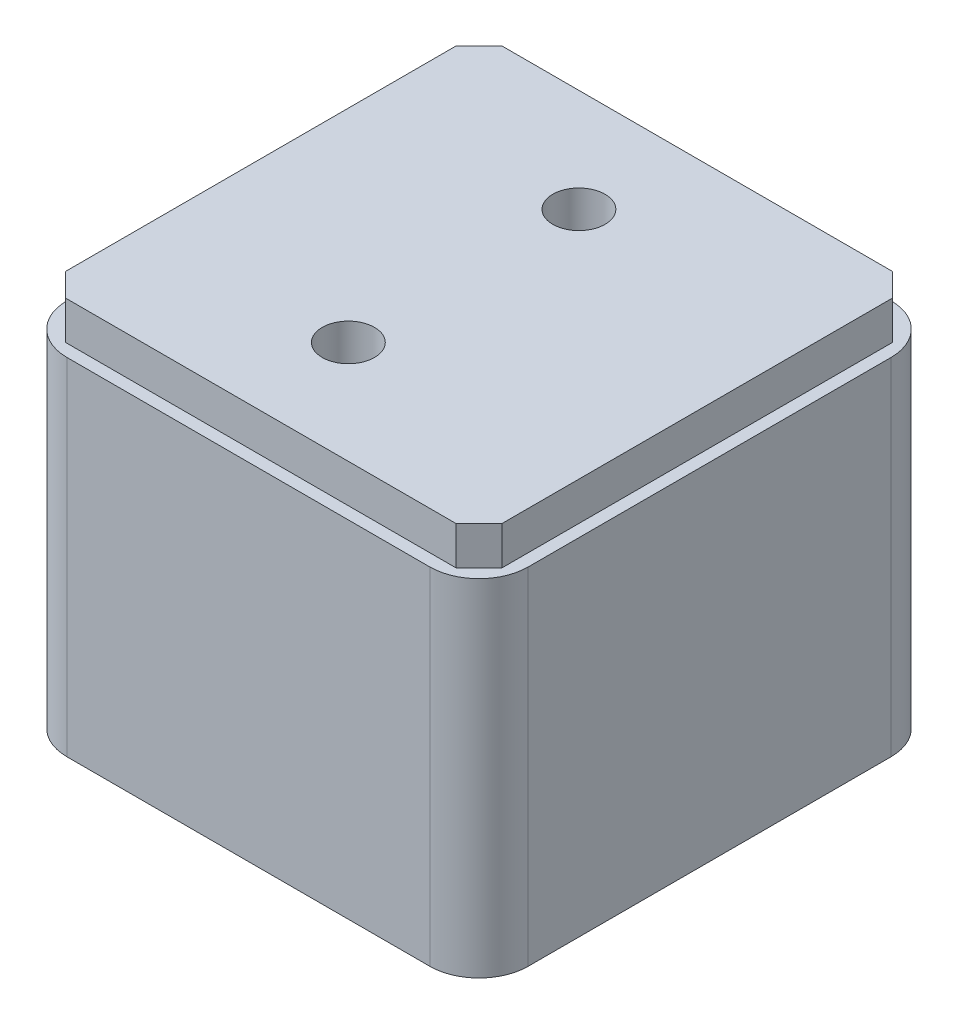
ISO-10303-21;
HEADER;
FILE_DESCRIPTION(('STEP AP214'),'2;1');
FILE_NAME('part.step','',(''),(''),'','','');
FILE_SCHEMA(('AUTOMOTIVE_DESIGN { 1 0 10303 214 1 1 1 1 }'));
ENDSEC;
DATA;
#1=APPLICATION_CONTEXT('core data for automotive mechanical design processes');
#2=APPLICATION_PROTOCOL_DEFINITION('international standard','automotive_design',2000,#1);
#3=PRODUCT_CONTEXT('',#1,'mechanical');
#4=PRODUCT('Part','Part','',(#3));
#5=PRODUCT_RELATED_PRODUCT_CATEGORY('part','',(#4));
#6=PRODUCT_DEFINITION_FORMATION('','',#4);
#7=PRODUCT_DEFINITION_CONTEXT('part definition',#1,'design');
#8=PRODUCT_DEFINITION('design','',#6,#7);
#9=PRODUCT_DEFINITION_SHAPE('','',#8);
#10=(LENGTH_UNIT() NAMED_UNIT(*) SI_UNIT(.MILLI.,.METRE.));
#11=(NAMED_UNIT(*) PLANE_ANGLE_UNIT() SI_UNIT($,.RADIAN.));
#12=(NAMED_UNIT(*) SI_UNIT($,.STERADIAN.) SOLID_ANGLE_UNIT());
#13=UNCERTAINTY_MEASURE_WITH_UNIT(LENGTH_MEASURE(1.E-05),#10,'distance_accuracy_value','');
#14=(GEOMETRIC_REPRESENTATION_CONTEXT(3) GLOBAL_UNCERTAINTY_ASSIGNED_CONTEXT((#13)) GLOBAL_UNIT_ASSIGNED_CONTEXT((#10,
#11,#12)) REPRESENTATION_CONTEXT('',''));
#15=CARTESIAN_POINT('',(0.,0.,0.));
#16=DIRECTION('',(0.,0.,1.));
#17=DIRECTION('',(1.,0.,0.));
#18=AXIS2_PLACEMENT_3D('',#15,#16,#17);
#19=CARTESIAN_POINT('',(-28.4,45.,25.4));
#20=DIRECTION('',(-0.707106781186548,0.,0.707106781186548));
#21=DIRECTION('',(0.707106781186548,0.,0.707106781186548));
#22=AXIS2_PLACEMENT_3D('',#19,#20,#21);
#23=PLANE('',#22);
#24=DIRECTION('',(0.707106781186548,0.,0.707106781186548));
#25=VECTOR('',#24,1.);
#26=CARTESIAN_POINT('',(-28.4,50.,25.4));
#27=LINE('',#26,#25);
#28=CARTESIAN_POINT('',(-28.4,50.,25.4));
#29=VERTEX_POINT('',#28);
#30=CARTESIAN_POINT('',(-25.4,50.,28.4));
#31=VERTEX_POINT('',#30);
#32=EDGE_CURVE('E181',#29,#31,#27,.T.);
#33=ORIENTED_EDGE('',*,*,#32,.F.);
#34=DIRECTION('',(0.,1.,0.));
#35=VECTOR('',#34,1.);
#36=CARTESIAN_POINT('',(-28.4,45.,25.4));
#37=LINE('',#36,#35);
#38=CARTESIAN_POINT('',(-28.4,45.,25.4));
#39=VERTEX_POINT('',#38);
#40=EDGE_CURVE('E13',#39,#29,#37,.T.);
#41=ORIENTED_EDGE('',*,*,#40,.F.);
#42=DIRECTION('',(0.707106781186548,0.,0.707106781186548));
#43=VECTOR('',#42,1.);
#44=CARTESIAN_POINT('',(-28.4,45.,25.4));
#45=LINE('',#44,#43);
#46=CARTESIAN_POINT('',(-25.4,45.,28.4));
#47=VERTEX_POINT('',#46);
#48=EDGE_CURVE('E202',#39,#47,#45,.T.);
#49=ORIENTED_EDGE('',*,*,#48,.T.);
#50=DIRECTION('',(0.,1.,0.));
#51=VECTOR('',#50,1.);
#52=CARTESIAN_POINT('',(-25.4,45.,28.4));
#53=LINE('',#52,#51);
#54=EDGE_CURVE('E87',#47,#31,#53,.T.);
#55=ORIENTED_EDGE('',*,*,#54,.T.);
#56=EDGE_LOOP('',(#33,#41,#49,#55));
#57=FACE_BOUND('',#56,.T.);
#58=ADVANCED_FACE('F84',(#57),#23,.T.);
#59=CARTESIAN_POINT('',(-28.4,45.,-25.4));
#60=DIRECTION('',(-1.,0.,0.));
#61=DIRECTION('',(0.,0.,1.));
#62=AXIS2_PLACEMENT_3D('',#59,#60,#61);
#63=PLANE('',#62);
#64=DIRECTION('',(0.,0.,1.));
#65=VECTOR('',#64,1.);
#66=CARTESIAN_POINT('',(-28.4,50.,-25.4));
#67=LINE('',#66,#65);
#68=CARTESIAN_POINT('',(-28.4,50.,-25.4));
#69=VERTEX_POINT('',#68);
#70=EDGE_CURVE('E200',#69,#29,#67,.T.);
#71=ORIENTED_EDGE('',*,*,#70,.F.);
#72=DIRECTION('',(0.,1.,0.));
#73=VECTOR('',#72,1.);
#74=CARTESIAN_POINT('',(-28.4,45.,-25.4));
#75=LINE('',#74,#73);
#76=CARTESIAN_POINT('',(-28.4,45.,-25.4));
#77=VERTEX_POINT('',#76);
#78=EDGE_CURVE('E93',#77,#69,#75,.T.);
#79=ORIENTED_EDGE('',*,*,#78,.F.);
#80=DIRECTION('',(0.,0.,1.));
#81=VECTOR('',#80,1.);
#82=CARTESIAN_POINT('',(-28.4,45.,-25.4));
#83=LINE('',#82,#81);
#84=EDGE_CURVE('E171',#77,#39,#83,.T.);
#85=ORIENTED_EDGE('',*,*,#84,.T.);
#86=ORIENTED_EDGE('',*,*,#40,.T.);
#87=EDGE_LOOP('',(#71,#79,#85,#86));
#88=FACE_BOUND('',#87,.T.);
#89=ADVANCED_FACE('F214',(#88),#63,.T.);
#90=CARTESIAN_POINT('',(-25.4,45.,-28.4));
#91=DIRECTION('',(-0.707106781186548,0.,-0.707106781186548));
#92=DIRECTION('',(-0.707106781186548,0.,0.707106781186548));
#93=AXIS2_PLACEMENT_3D('',#90,#91,#92);
#94=PLANE('',#93);
#95=DIRECTION('',(-0.707106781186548,0.,0.707106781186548));
#96=VECTOR('',#95,1.);
#97=CARTESIAN_POINT('',(-25.4,50.,-28.4));
#98=LINE('',#97,#96);
#99=CARTESIAN_POINT('',(-25.4,50.,-28.4));
#100=VERTEX_POINT('',#99);
#101=EDGE_CURVE('E158',#100,#69,#98,.T.);
#102=ORIENTED_EDGE('',*,*,#101,.F.);
#103=DIRECTION('',(0.,1.,0.));
#104=VECTOR('',#103,1.);
#105=CARTESIAN_POINT('',(-25.4,45.,-28.4));
#106=LINE('',#105,#104);
#107=CARTESIAN_POINT('',(-25.4,45.,-28.4));
#108=VERTEX_POINT('',#107);
#109=EDGE_CURVE('E153',#108,#100,#106,.T.);
#110=ORIENTED_EDGE('',*,*,#109,.F.);
#111=DIRECTION('',(-0.707106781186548,0.,0.707106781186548));
#112=VECTOR('',#111,1.);
#113=CARTESIAN_POINT('',(-25.4,45.,-28.4));
#114=LINE('',#113,#112);
#115=EDGE_CURVE('E156',#108,#77,#114,.T.);
#116=ORIENTED_EDGE('',*,*,#115,.T.);
#117=ORIENTED_EDGE('',*,*,#78,.T.);
#118=EDGE_LOOP('',(#102,#110,#116,#117));
#119=FACE_BOUND('',#118,.T.);
#120=ADVANCED_FACE('F155',(#119),#94,.T.);
#121=CARTESIAN_POINT('',(25.4,45.,-28.4));
#122=DIRECTION('',(0.,0.,-1.));
#123=DIRECTION('',(-1.,0.,0.));
#124=AXIS2_PLACEMENT_3D('',#121,#122,#123);
#125=PLANE('',#124);
#126=DIRECTION('',(-1.,0.,0.));
#127=VECTOR('',#126,1.);
#128=CARTESIAN_POINT('',(25.4,50.,-28.4));
#129=LINE('',#128,#127);
#130=CARTESIAN_POINT('',(25.4,50.,-28.4));
#131=VERTEX_POINT('',#130);
#132=EDGE_CURVE('E197',#131,#100,#129,.T.);
#133=ORIENTED_EDGE('',*,*,#132,.F.);
#134=DIRECTION('',(0.,1.,0.));
#135=VECTOR('',#134,1.);
#136=CARTESIAN_POINT('',(25.4,45.,-28.4));
#137=LINE('',#136,#135);
#138=CARTESIAN_POINT('',(25.4,45.,-28.4));
#139=VERTEX_POINT('',#138);
#140=EDGE_CURVE('E163',#139,#131,#137,.T.);
#141=ORIENTED_EDGE('',*,*,#140,.F.);
#142=DIRECTION('',(-1.,0.,0.));
#143=VECTOR('',#142,1.);
#144=CARTESIAN_POINT('',(25.4,45.,-28.4));
#145=LINE('',#144,#143);
#146=EDGE_CURVE('E169',#139,#108,#145,.T.);
#147=ORIENTED_EDGE('',*,*,#146,.T.);
#148=ORIENTED_EDGE('',*,*,#109,.T.);
#149=EDGE_LOOP('',(#133,#141,#147,#148));
#150=FACE_BOUND('',#149,.T.);
#151=ADVANCED_FACE('F173',(#150),#125,.T.);
#152=CARTESIAN_POINT('',(28.4,45.,-25.4));
#153=DIRECTION('',(0.707106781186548,0.,-0.707106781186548));
#154=DIRECTION('',(-0.707106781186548,0.,-0.707106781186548));
#155=AXIS2_PLACEMENT_3D('',#152,#153,#154);
#156=PLANE('',#155);
#157=DIRECTION('',(-0.707106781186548,0.,-0.707106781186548));
#158=VECTOR('',#157,1.);
#159=CARTESIAN_POINT('',(28.4,50.,-25.4));
#160=LINE('',#159,#158);
#161=CARTESIAN_POINT('',(28.4,50.,-25.4));
#162=VERTEX_POINT('',#161);
#163=EDGE_CURVE('E194',#162,#131,#160,.T.);
#164=ORIENTED_EDGE('',*,*,#163,.F.);
#165=DIRECTION('',(0.,1.,0.));
#166=VECTOR('',#165,1.);
#167=CARTESIAN_POINT('',(28.4,45.,-25.4));
#168=LINE('',#167,#166);
#169=CARTESIAN_POINT('',(28.4,45.,-25.4));
#170=VERTEX_POINT('',#169);
#171=EDGE_CURVE('E206',#170,#162,#168,.T.);
#172=ORIENTED_EDGE('',*,*,#171,.F.);
#173=DIRECTION('',(-0.707106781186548,0.,-0.707106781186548));
#174=VECTOR('',#173,1.);
#175=CARTESIAN_POINT('',(28.4,45.,-25.4));
#176=LINE('',#175,#174);
#177=EDGE_CURVE('E174',#170,#139,#176,.T.);
#178=ORIENTED_EDGE('',*,*,#177,.T.);
#179=ORIENTED_EDGE('',*,*,#140,.T.);
#180=EDGE_LOOP('',(#164,#172,#178,#179));
#181=FACE_BOUND('',#180,.T.);
#182=ADVANCED_FACE('F227',(#181),#156,.T.);
#183=CARTESIAN_POINT('',(28.4,45.,25.4));
#184=DIRECTION('',(1.,0.,0.));
#185=DIRECTION('',(0.,0.,-1.));
#186=AXIS2_PLACEMENT_3D('',#183,#184,#185);
#187=PLANE('',#186);
#188=DIRECTION('',(0.,0.,-1.));
#189=VECTOR('',#188,1.);
#190=CARTESIAN_POINT('',(28.4,50.,25.4));
#191=LINE('',#190,#189);
#192=CARTESIAN_POINT('',(28.4,50.,25.4));
#193=VERTEX_POINT('',#192);
#194=EDGE_CURVE('E191',#193,#162,#191,.T.);
#195=ORIENTED_EDGE('',*,*,#194,.F.);
#196=DIRECTION('',(0.,1.,0.));
#197=VECTOR('',#196,1.);
#198=CARTESIAN_POINT('',(28.4,45.,25.4));
#199=LINE('',#198,#197);
#200=CARTESIAN_POINT('',(28.4,45.,25.4));
#201=VERTEX_POINT('',#200);
#202=EDGE_CURVE('E208',#201,#193,#199,.T.);
#203=ORIENTED_EDGE('',*,*,#202,.F.);
#204=DIRECTION('',(0.,0.,-1.));
#205=VECTOR('',#204,1.);
#206=CARTESIAN_POINT('',(28.4,45.,25.4));
#207=LINE('',#206,#205);
#208=EDGE_CURVE('E176',#201,#170,#207,.T.);
#209=ORIENTED_EDGE('',*,*,#208,.T.);
#210=ORIENTED_EDGE('',*,*,#171,.T.);
#211=EDGE_LOOP('',(#195,#203,#209,#210));
#212=FACE_BOUND('',#211,.T.);
#213=ADVANCED_FACE('F230',(#212),#187,.T.);
#214=CARTESIAN_POINT('',(25.4,45.,28.4));
#215=DIRECTION('',(0.707106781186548,0.,0.707106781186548));
#216=DIRECTION('',(0.707106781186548,0.,-0.707106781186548));
#217=AXIS2_PLACEMENT_3D('',#214,#215,#216);
#218=PLANE('',#217);
#219=DIRECTION('',(0.707106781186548,0.,-0.707106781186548));
#220=VECTOR('',#219,1.);
#221=CARTESIAN_POINT('',(25.4,50.,28.4));
#222=LINE('',#221,#220);
#223=CARTESIAN_POINT('',(25.4,50.,28.4));
#224=VERTEX_POINT('',#223);
#225=EDGE_CURVE('E188',#224,#193,#222,.T.);
#226=ORIENTED_EDGE('',*,*,#225,.F.);
#227=DIRECTION('',(0.,1.,0.));
#228=VECTOR('',#227,1.);
#229=CARTESIAN_POINT('',(25.4,45.,28.4));
#230=LINE('',#229,#228);
#231=CARTESIAN_POINT('',(25.4,45.,28.4));
#232=VERTEX_POINT('',#231);
#233=EDGE_CURVE('E209',#232,#224,#230,.T.);
#234=ORIENTED_EDGE('',*,*,#233,.F.);
#235=DIRECTION('',(0.707106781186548,0.,-0.707106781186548));
#236=VECTOR('',#235,1.);
#237=CARTESIAN_POINT('',(25.4,45.,28.4));
#238=LINE('',#237,#236);
#239=EDGE_CURVE('E276',#232,#201,#238,.T.);
#240=ORIENTED_EDGE('',*,*,#239,.T.);
#241=ORIENTED_EDGE('',*,*,#202,.T.);
#242=EDGE_LOOP('',(#226,#234,#240,#241));
#243=FACE_BOUND('',#242,.T.);
#244=ADVANCED_FACE('F234',(#243),#218,.T.);
#245=CARTESIAN_POINT('',(-25.4,45.,28.4));
#246=DIRECTION('',(0.,0.,1.));
#247=DIRECTION('',(1.,0.,0.));
#248=AXIS2_PLACEMENT_3D('',#245,#246,#247);
#249=PLANE('',#248);
#250=DIRECTION('',(1.,0.,0.));
#251=VECTOR('',#250,1.);
#252=CARTESIAN_POINT('',(-25.4,50.,28.4));
#253=LINE('',#252,#251);
#254=EDGE_CURVE('E184',#31,#224,#253,.T.);
#255=ORIENTED_EDGE('',*,*,#254,.F.);
#256=ORIENTED_EDGE('',*,*,#54,.F.);
#257=DIRECTION('',(1.,0.,0.));
#258=VECTOR('',#257,1.);
#259=CARTESIAN_POINT('',(-25.4,45.,28.4));
#260=LINE('',#259,#258);
#261=EDGE_CURVE('E274',#47,#232,#260,.T.);
#262=ORIENTED_EDGE('',*,*,#261,.T.);
#263=ORIENTED_EDGE('',*,*,#233,.T.);
#264=EDGE_LOOP('',(#255,#256,#262,#263));
#265=FACE_BOUND('',#264,.T.);
#266=ADVANCED_FACE('F211',(#265),#249,.T.);
#267=CARTESIAN_POINT('',(0.,45.,53.8));
#268=DIRECTION('',(0.,1.,0.));
#269=DIRECTION('',(0.,0.,1.));
#270=AXIS2_PLACEMENT_3D('',#267,#268,#269);
#271=PLANE('',#270);
#272=CARTESIAN_POINT('',(-2.,45.,-15.));
#273=DIRECTION('',(0.,1.,0.));
#274=DIRECTION('',(0.,0.,1.));
#275=AXIS2_PLACEMENT_3D('',#272,#273,#274);
#276=CIRCLE('',#275,3.39999999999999);
#277=CARTESIAN_POINT('',(-2.,45.,-11.6));
#278=VERTEX_POINT('',#277);
#279=EDGE_CURVE('E264',#278,#278,#276,.T.);
#280=ORIENTED_EDGE('',*,*,#279,.T.);
#281=EDGE_LOOP('',(#280));
#282=FACE_BOUND('',#281,.T.);
#283=CARTESIAN_POINT('',(-2.,45.,15.));
#284=DIRECTION('',(0.,1.,0.));
#285=DIRECTION('',(0.,0.,1.));
#286=AXIS2_PLACEMENT_3D('',#283,#284,#285);
#287=CIRCLE('',#286,3.39999999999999);
#288=CARTESIAN_POINT('',(-2.,45.,18.4));
#289=VERTEX_POINT('',#288);
#290=EDGE_CURVE('E185',#289,#289,#287,.T.);
#291=ORIENTED_EDGE('',*,*,#290,.T.);
#292=EDGE_LOOP('',(#291));
#293=FACE_BOUND('',#292,.T.);
#294=ORIENTED_EDGE('',*,*,#48,.F.);
#295=ORIENTED_EDGE('',*,*,#84,.F.);
#296=ORIENTED_EDGE('',*,*,#115,.F.);
#297=ORIENTED_EDGE('',*,*,#146,.F.);
#298=ORIENTED_EDGE('',*,*,#177,.F.);
#299=ORIENTED_EDGE('',*,*,#208,.F.);
#300=ORIENTED_EDGE('',*,*,#239,.F.);
#301=ORIENTED_EDGE('',*,*,#261,.F.);
#302=EDGE_LOOP('',(#294,#295,#296,#297,#298,#299,#300,#301));
#303=FACE_BOUND('',#302,.T.);
#304=ADVANCED_FACE('F167',(#282,#293,#303),#271,.F.);
#305=CARTESIAN_POINT('',(0.,50.,53.8));
#306=DIRECTION('',(0.,1.,0.));
#307=DIRECTION('',(0.,0.,1.));
#308=AXIS2_PLACEMENT_3D('',#305,#306,#307);
#309=PLANE('',#308);
#310=CARTESIAN_POINT('',(-2.,50.,-15.));
#311=DIRECTION('',(0.,1.,0.));
#312=DIRECTION('',(0.,0.,1.));
#313=AXIS2_PLACEMENT_3D('',#310,#311,#312);
#314=CIRCLE('',#313,3.39999999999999);
#315=CARTESIAN_POINT('',(-2.,50.,-11.6));
#316=VERTEX_POINT('',#315);
#317=EDGE_CURVE('E262',#316,#316,#314,.T.);
#318=ORIENTED_EDGE('',*,*,#317,.F.);
#319=EDGE_LOOP('',(#318));
#320=FACE_BOUND('',#319,.T.);
#321=CARTESIAN_POINT('',(-2.,50.,15.));
#322=DIRECTION('',(0.,1.,0.));
#323=DIRECTION('',(0.,0.,1.));
#324=AXIS2_PLACEMENT_3D('',#321,#322,#323);
#325=CIRCLE('',#324,3.39999999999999);
#326=CARTESIAN_POINT('',(-2.,50.,18.4));
#327=VERTEX_POINT('',#326);
#328=EDGE_CURVE('E265',#327,#327,#325,.T.);
#329=ORIENTED_EDGE('',*,*,#328,.F.);
#330=EDGE_LOOP('',(#329));
#331=FACE_BOUND('',#330,.T.);
#332=ORIENTED_EDGE('',*,*,#32,.T.);
#333=ORIENTED_EDGE('',*,*,#254,.T.);
#334=ORIENTED_EDGE('',*,*,#225,.T.);
#335=ORIENTED_EDGE('',*,*,#194,.T.);
#336=ORIENTED_EDGE('',*,*,#163,.T.);
#337=ORIENTED_EDGE('',*,*,#132,.T.);
#338=ORIENTED_EDGE('',*,*,#101,.T.);
#339=ORIENTED_EDGE('',*,*,#70,.T.);
#340=EDGE_LOOP('',(#332,#333,#334,#335,#336,#337,#338,#339));
#341=FACE_BOUND('',#340,.T.);
#342=ADVANCED_FACE('F213',(#320,#331,#341),#309,.T.);
#343=CARTESIAN_POINT('',(-2.,50.,15.));
#344=DIRECTION('',(0.,1.,0.));
#345=DIRECTION('',(0.,0.,1.));
#346=AXIS2_PLACEMENT_3D('',#343,#344,#345);
#347=CYLINDRICAL_SURFACE('',#346,3.39999999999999);
#348=ORIENTED_EDGE('',*,*,#328,.T.);
#349=EDGE_LOOP('',(#348));
#350=FACE_BOUND('',#349,.T.);
#351=ORIENTED_EDGE('',*,*,#290,.F.);
#352=EDGE_LOOP('',(#351));
#353=FACE_BOUND('',#352,.T.);
#354=ADVANCED_FACE('F246',(#350,#353),#347,.F.);
#355=CARTESIAN_POINT('',(-2.,50.,-15.));
#356=DIRECTION('',(0.,1.,0.));
#357=DIRECTION('',(0.,0.,1.));
#358=AXIS2_PLACEMENT_3D('',#355,#356,#357);
#359=CYLINDRICAL_SURFACE('',#358,3.39999999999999);
#360=ORIENTED_EDGE('',*,*,#317,.T.);
#361=EDGE_LOOP('',(#360));
#362=FACE_BOUND('',#361,.T.);
#363=ORIENTED_EDGE('',*,*,#279,.F.);
#364=EDGE_LOOP('',(#363));
#365=FACE_BOUND('',#364,.T.);
#366=ADVANCED_FACE('F253',(#362,#365),#359,.F.);
#367=CLOSED_SHELL('',(#58,#89,#120,#151,#182,#213,#244,#266,#304,#342,#354,#366));
#368=MANIFOLD_SOLID_BREP('B2',#367);
#369=CARTESIAN_POINT('',(-23.6,50.,23.6));
#370=DIRECTION('',(0.,-1.,0.));
#371=DIRECTION('',(0.,0.,-1.));
#372=AXIS2_PLACEMENT_3D('',#369,#370,#371);
#373=CYLINDRICAL_SURFACE('',#372,6.4);
#374=CARTESIAN_POINT('',(-23.6,0.,23.6));
#375=DIRECTION('',(0.,1.,0.));
#376=DIRECTION('',(0.,0.,1.));
#377=AXIS2_PLACEMENT_3D('',#374,#375,#376);
#378=CIRCLE('',#377,6.4);
#379=CARTESIAN_POINT('',(-30.,0.,23.6));
#380=VERTEX_POINT('',#379);
#381=CARTESIAN_POINT('',(-23.6,0.,30.));
#382=VERTEX_POINT('',#381);
#383=EDGE_CURVE('E526',#380,#382,#378,.T.);
#384=ORIENTED_EDGE('',*,*,#383,.T.);
#385=DIRECTION('',(0.,-1.,0.));
#386=VECTOR('',#385,1.);
#387=CARTESIAN_POINT('',(-23.6,50.,30.));
#388=LINE('',#387,#386);
#389=CARTESIAN_POINT('',(-23.6,45.,30.));
#390=VERTEX_POINT('',#389);
#391=EDGE_CURVE('E82',#390,#382,#388,.T.);
#392=ORIENTED_EDGE('',*,*,#391,.F.);
#393=CARTESIAN_POINT('',(-23.6,45.,23.6));
#394=DIRECTION('',(0.,1.,0.));
#395=DIRECTION('',(0.,0.,1.));
#396=AXIS2_PLACEMENT_3D('',#393,#394,#395);
#397=CIRCLE('',#396,6.4);
#398=CARTESIAN_POINT('',(-30.,45.,23.6));
#399=VERTEX_POINT('',#398);
#400=EDGE_CURVE('E573',#399,#390,#397,.T.);
#401=ORIENTED_EDGE('',*,*,#400,.F.);
#402=DIRECTION('',(0.,-1.,0.));
#403=VECTOR('',#402,1.);
#404=CARTESIAN_POINT('',(-30.,50.,23.6));
#405=LINE('',#404,#403);
#406=EDGE_CURVE('E497',#399,#380,#405,.T.);
#407=ORIENTED_EDGE('',*,*,#406,.T.);
#408=EDGE_LOOP('',(#384,#392,#401,#407));
#409=FACE_BOUND('',#408,.T.);
#410=ADVANCED_FACE('F357',(#409),#373,.T.);
#411=CARTESIAN_POINT('',(-23.6,50.,30.));
#412=DIRECTION('',(0.,0.,-1.));
#413=DIRECTION('',(-1.,0.,0.));
#414=AXIS2_PLACEMENT_3D('',#411,#412,#413);
#415=PLANE('',#414);
#416=DIRECTION('',(1.,0.,0.));
#417=VECTOR('',#416,1.);
#418=CARTESIAN_POINT('',(-23.6,0.,30.));
#419=LINE('',#418,#417);
#420=CARTESIAN_POINT('',(23.6,0.,30.));
#421=VERTEX_POINT('',#420);
#422=EDGE_CURVE('E529',#382,#421,#419,.T.);
#423=ORIENTED_EDGE('',*,*,#422,.T.);
#424=DIRECTION('',(0.,-1.,0.));
#425=VECTOR('',#424,1.);
#426=CARTESIAN_POINT('',(23.6,50.,30.));
#427=LINE('',#426,#425);
#428=CARTESIAN_POINT('',(23.6,45.,30.));
#429=VERTEX_POINT('',#428);
#430=EDGE_CURVE('E367',#429,#421,#427,.T.);
#431=ORIENTED_EDGE('',*,*,#430,.F.);
#432=DIRECTION('',(1.,0.,0.));
#433=VECTOR('',#432,1.);
#434=CARTESIAN_POINT('',(-23.6,45.,30.));
#435=LINE('',#434,#433);
#436=EDGE_CURVE('E361',#390,#429,#435,.T.);
#437=ORIENTED_EDGE('',*,*,#436,.F.);
#438=ORIENTED_EDGE('',*,*,#391,.T.);
#439=EDGE_LOOP('',(#423,#431,#437,#438));
#440=FACE_BOUND('',#439,.T.);
#441=ADVANCED_FACE('F627',(#440),#415,.F.);
#442=CARTESIAN_POINT('',(23.6,50.,23.6));
#443=DIRECTION('',(0.,-1.,0.));
#444=DIRECTION('',(0.,0.,-1.));
#445=AXIS2_PLACEMENT_3D('',#442,#443,#444);
#446=CYLINDRICAL_SURFACE('',#445,6.4);
#447=CARTESIAN_POINT('',(23.6,0.,23.6));
#448=DIRECTION('',(0.,1.,0.));
#449=DIRECTION('',(0.,0.,1.));
#450=AXIS2_PLACEMENT_3D('',#447,#448,#449);
#451=CIRCLE('',#450,6.4);
#452=CARTESIAN_POINT('',(30.,0.,23.6));
#453=VERTEX_POINT('',#452);
#454=EDGE_CURVE('E531',#421,#453,#451,.T.);
#455=ORIENTED_EDGE('',*,*,#454,.T.);
#456=DIRECTION('',(0.,-1.,0.));
#457=VECTOR('',#456,1.);
#458=CARTESIAN_POINT('',(30.,50.,23.6));
#459=LINE('',#458,#457);
#460=CARTESIAN_POINT('',(30.,45.,23.6));
#461=VERTEX_POINT('',#460);
#462=EDGE_CURVE('E553',#461,#453,#459,.T.);
#463=ORIENTED_EDGE('',*,*,#462,.F.);
#464=CARTESIAN_POINT('',(23.6,45.,23.6));
#465=DIRECTION('',(0.,1.,0.));
#466=DIRECTION('',(0.,0.,1.));
#467=AXIS2_PLACEMENT_3D('',#464,#465,#466);
#468=CIRCLE('',#467,6.4);
#469=EDGE_CURVE('E599',#429,#461,#468,.T.);
#470=ORIENTED_EDGE('',*,*,#469,.F.);
#471=ORIENTED_EDGE('',*,*,#430,.T.);
#472=EDGE_LOOP('',(#455,#463,#470,#471));
#473=FACE_BOUND('',#472,.T.);
#474=ADVANCED_FACE('F605',(#473),#446,.T.);
#475=CARTESIAN_POINT('',(30.,50.,-23.6));
#476=DIRECTION('',(-1.,0.,0.));
#477=DIRECTION('',(0.,0.,1.));
#478=AXIS2_PLACEMENT_3D('',#475,#476,#477);
#479=PLANE('',#478);
#480=DIRECTION('',(0.,0.,-1.));
#481=VECTOR('',#480,1.);
#482=CARTESIAN_POINT('',(30.,0.,-23.6));
#483=LINE('',#482,#481);
#484=CARTESIAN_POINT('',(30.,0.,-23.6));
#485=VERTEX_POINT('',#484);
#486=EDGE_CURVE('E533',#453,#485,#483,.T.);
#487=ORIENTED_EDGE('',*,*,#486,.T.);
#488=DIRECTION('',(0.,-1.,0.));
#489=VECTOR('',#488,1.);
#490=CARTESIAN_POINT('',(30.,50.,-23.6));
#491=LINE('',#490,#489);
#492=CARTESIAN_POINT('',(30.,45.,-23.6));
#493=VERTEX_POINT('',#492);
#494=EDGE_CURVE('E550',#493,#485,#491,.T.);
#495=ORIENTED_EDGE('',*,*,#494,.F.);
#496=DIRECTION('',(0.,0.,-1.));
#497=VECTOR('',#496,1.);
#498=CARTESIAN_POINT('',(30.,45.,-23.6));
#499=LINE('',#498,#497);
#500=EDGE_CURVE('E598',#461,#493,#499,.T.);
#501=ORIENTED_EDGE('',*,*,#500,.F.);
#502=ORIENTED_EDGE('',*,*,#462,.T.);
#503=EDGE_LOOP('',(#487,#495,#501,#502));
#504=FACE_BOUND('',#503,.T.);
#505=ADVANCED_FACE('F609',(#504),#479,.F.);
#506=CARTESIAN_POINT('',(23.6,50.,-23.6));
#507=DIRECTION('',(0.,-1.,0.));
#508=DIRECTION('',(0.,0.,-1.));
#509=AXIS2_PLACEMENT_3D('',#506,#507,#508);
#510=CYLINDRICAL_SURFACE('',#509,6.4);
#511=CARTESIAN_POINT('',(23.6,0.,-23.6));
#512=DIRECTION('',(0.,1.,0.));
#513=DIRECTION('',(0.,0.,1.));
#514=AXIS2_PLACEMENT_3D('',#511,#512,#513);
#515=CIRCLE('',#514,6.4);
#516=CARTESIAN_POINT('',(23.6,0.,-30.));
#517=VERTEX_POINT('',#516);
#518=EDGE_CURVE('E535',#485,#517,#515,.T.);
#519=ORIENTED_EDGE('',*,*,#518,.T.);
#520=DIRECTION('',(0.,-1.,0.));
#521=VECTOR('',#520,1.);
#522=CARTESIAN_POINT('',(23.6,50.,-30.));
#523=LINE('',#522,#521);
#524=CARTESIAN_POINT('',(23.6,45.,-30.));
#525=VERTEX_POINT('',#524);
#526=EDGE_CURVE('E547',#525,#517,#523,.T.);
#527=ORIENTED_EDGE('',*,*,#526,.F.);
#528=CARTESIAN_POINT('',(23.6,45.,-23.6));
#529=DIRECTION('',(0.,1.,0.));
#530=DIRECTION('',(0.,0.,1.));
#531=AXIS2_PLACEMENT_3D('',#528,#529,#530);
#532=CIRCLE('',#531,6.4);
#533=EDGE_CURVE('E596',#493,#525,#532,.T.);
#534=ORIENTED_EDGE('',*,*,#533,.F.);
#535=ORIENTED_EDGE('',*,*,#494,.T.);
#536=EDGE_LOOP('',(#519,#527,#534,#535));
#537=FACE_BOUND('',#536,.T.);
#538=ADVANCED_FACE('F614',(#537),#510,.T.);
#539=CARTESIAN_POINT('',(23.6,50.,-30.));
#540=DIRECTION('',(0.,0.,1.));
#541=DIRECTION('',(1.,0.,0.));
#542=AXIS2_PLACEMENT_3D('',#539,#540,#541);
#543=PLANE('',#542);
#544=DIRECTION('',(-1.,0.,0.));
#545=VECTOR('',#544,1.);
#546=CARTESIAN_POINT('',(23.6,0.,-30.));
#547=LINE('',#546,#545);
#548=CARTESIAN_POINT('',(-23.6,0.,-30.));
#549=VERTEX_POINT('',#548);
#550=EDGE_CURVE('E537',#517,#549,#547,.T.);
#551=ORIENTED_EDGE('',*,*,#550,.T.);
#552=DIRECTION('',(0.,-1.,0.));
#553=VECTOR('',#552,1.);
#554=CARTESIAN_POINT('',(-23.6,50.,-30.));
#555=LINE('',#554,#553);
#556=CARTESIAN_POINT('',(-23.6,45.,-30.));
#557=VERTEX_POINT('',#556);
#558=EDGE_CURVE('E545',#557,#549,#555,.T.);
#559=ORIENTED_EDGE('',*,*,#558,.F.);
#560=DIRECTION('',(-1.,0.,0.));
#561=VECTOR('',#560,1.);
#562=CARTESIAN_POINT('',(23.6,45.,-30.));
#563=LINE('',#562,#561);
#564=EDGE_CURVE('E594',#525,#557,#563,.T.);
#565=ORIENTED_EDGE('',*,*,#564,.F.);
#566=ORIENTED_EDGE('',*,*,#526,.T.);
#567=EDGE_LOOP('',(#551,#559,#565,#566));
#568=FACE_BOUND('',#567,.T.);
#569=ADVANCED_FACE('F619',(#568),#543,.F.);
#570=CARTESIAN_POINT('',(-23.6,50.,-23.6));
#571=DIRECTION('',(0.,-1.,0.));
#572=DIRECTION('',(0.,0.,-1.));
#573=AXIS2_PLACEMENT_3D('',#570,#571,#572);
#574=CYLINDRICAL_SURFACE('',#573,6.4);
#575=CARTESIAN_POINT('',(-23.6,0.,-23.6));
#576=DIRECTION('',(0.,1.,0.));
#577=DIRECTION('',(0.,0.,1.));
#578=AXIS2_PLACEMENT_3D('',#575,#576,#577);
#579=CIRCLE('',#578,6.4);
#580=CARTESIAN_POINT('',(-30.,0.,-23.6));
#581=VERTEX_POINT('',#580);
#582=EDGE_CURVE('E453',#549,#581,#579,.T.);
#583=ORIENTED_EDGE('',*,*,#582,.T.);
#584=DIRECTION('',(0.,-1.,0.));
#585=VECTOR('',#584,1.);
#586=CARTESIAN_POINT('',(-30.,50.,-23.6));
#587=LINE('',#586,#585);
#588=CARTESIAN_POINT('',(-30.,45.,-23.6));
#589=VERTEX_POINT('',#588);
#590=EDGE_CURVE('E543',#589,#581,#587,.T.);
#591=ORIENTED_EDGE('',*,*,#590,.F.);
#592=CARTESIAN_POINT('',(-23.6,45.,-23.6));
#593=DIRECTION('',(0.,1.,0.));
#594=DIRECTION('',(0.,0.,1.));
#595=AXIS2_PLACEMENT_3D('',#592,#593,#594);
#596=CIRCLE('',#595,6.4);
#597=EDGE_CURVE('E592',#557,#589,#596,.T.);
#598=ORIENTED_EDGE('',*,*,#597,.F.);
#599=ORIENTED_EDGE('',*,*,#558,.T.);
#600=EDGE_LOOP('',(#583,#591,#598,#599));
#601=FACE_BOUND('',#600,.T.);
#602=ADVANCED_FACE('F621',(#601),#574,.T.);
#603=CARTESIAN_POINT('',(23.6,50.,23.6));
#604=DIRECTION('',(0.,-1.,0.));
#605=DIRECTION('',(0.,0.,-1.));
#606=AXIS2_PLACEMENT_3D('',#603,#604,#605);
#607=CYLINDRICAL_SURFACE('',#606,3.20000000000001);
#608=CARTESIAN_POINT('',(23.6,0.,23.6));
#609=DIRECTION('',(0.,1.,0.));
#610=DIRECTION('',(0.,0.,1.));
#611=AXIS2_PLACEMENT_3D('',#608,#609,#610);
#612=CIRCLE('',#611,3.20000000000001);
#613=CARTESIAN_POINT('',(23.6,0.,26.8));
#614=VERTEX_POINT('',#613);
#615=CARTESIAN_POINT('',(26.8,0.,23.6));
#616=VERTEX_POINT('',#615);
#617=EDGE_CURVE('E500',#614,#616,#612,.T.);
#618=ORIENTED_EDGE('',*,*,#617,.F.);
#619=DIRECTION('',(0.,-1.,0.));
#620=VECTOR('',#619,1.);
#621=CARTESIAN_POINT('',(23.6,50.,26.8));
#622=LINE('',#621,#620);
#623=CARTESIAN_POINT('',(23.6,45.,26.8));
#624=VERTEX_POINT('',#623);
#625=EDGE_CURVE('E438',#624,#614,#622,.T.);
#626=ORIENTED_EDGE('',*,*,#625,.F.);
#627=CARTESIAN_POINT('',(23.6,45.,23.6));
#628=DIRECTION('',(0.,1.,0.));
#629=DIRECTION('',(0.,0.,1.));
#630=AXIS2_PLACEMENT_3D('',#627,#628,#629);
#631=CIRCLE('',#630,3.20000000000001);
#632=CARTESIAN_POINT('',(26.8,45.,23.6));
#633=VERTEX_POINT('',#632);
#634=EDGE_CURVE('E541',#624,#633,#631,.T.);
#635=ORIENTED_EDGE('',*,*,#634,.T.);
#636=DIRECTION('',(0.,-1.,0.));
#637=VECTOR('',#636,1.);
#638=CARTESIAN_POINT('',(26.8,50.,23.6));
#639=LINE('',#638,#637);
#640=EDGE_CURVE('E407',#633,#616,#639,.T.);
#641=ORIENTED_EDGE('',*,*,#640,.T.);
#642=EDGE_LOOP('',(#618,#626,#635,#641));
#643=FACE_BOUND('',#642,.T.);
#644=ADVANCED_FACE('F501',(#643),#607,.F.);
#645=CARTESIAN_POINT('',(-23.6,50.,26.8));
#646=DIRECTION('',(0.,0.,-1.));
#647=DIRECTION('',(-1.,0.,0.));
#648=AXIS2_PLACEMENT_3D('',#645,#646,#647);
#649=PLANE('',#648);
#650=DIRECTION('',(1.,0.,0.));
#651=VECTOR('',#650,1.);
#652=CARTESIAN_POINT('',(-23.6,0.,26.8));
#653=LINE('',#652,#651);
#654=CARTESIAN_POINT('',(-23.6,0.,26.8));
#655=VERTEX_POINT('',#654);
#656=EDGE_CURVE('E494',#655,#614,#653,.T.);
#657=ORIENTED_EDGE('',*,*,#656,.F.);
#658=DIRECTION('',(0.,-1.,0.));
#659=VECTOR('',#658,1.);
#660=CARTESIAN_POINT('',(-23.6,50.,26.8));
#661=LINE('',#660,#659);
#662=CARTESIAN_POINT('',(-23.6,45.,26.8));
#663=VERTEX_POINT('',#662);
#664=EDGE_CURVE('E432',#663,#655,#661,.T.);
#665=ORIENTED_EDGE('',*,*,#664,.F.);
#666=DIRECTION('',(1.,0.,0.));
#667=VECTOR('',#666,1.);
#668=CARTESIAN_POINT('',(-23.6,45.,26.8));
#669=LINE('',#668,#667);
#670=EDGE_CURVE('E496',#663,#624,#669,.T.);
#671=ORIENTED_EDGE('',*,*,#670,.T.);
#672=ORIENTED_EDGE('',*,*,#625,.T.);
#673=EDGE_LOOP('',(#657,#665,#671,#672));
#674=FACE_BOUND('',#673,.T.);
#675=ADVANCED_FACE('F492',(#674),#649,.T.);
#676=CARTESIAN_POINT('',(-23.6,50.,23.6));
#677=DIRECTION('',(0.,-1.,0.));
#678=DIRECTION('',(0.,0.,-1.));
#679=AXIS2_PLACEMENT_3D('',#676,#677,#678);
#680=CYLINDRICAL_SURFACE('',#679,3.20000000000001);
#681=CARTESIAN_POINT('',(-23.6,0.,23.6));
#682=DIRECTION('',(0.,1.,0.));
#683=DIRECTION('',(0.,0.,1.));
#684=AXIS2_PLACEMENT_3D('',#681,#682,#683);
#685=CIRCLE('',#684,3.20000000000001);
#686=CARTESIAN_POINT('',(-26.8,0.,23.6));
#687=VERTEX_POINT('',#686);
#688=EDGE_CURVE('E509',#687,#655,#685,.T.);
#689=ORIENTED_EDGE('',*,*,#688,.F.);
#690=DIRECTION('',(0.,-1.,0.));
#691=VECTOR('',#690,1.);
#692=CARTESIAN_POINT('',(-26.8,50.,23.6));
#693=LINE('',#692,#691);
#694=CARTESIAN_POINT('',(-26.8,45.,23.6));
#695=VERTEX_POINT('',#694);
#696=EDGE_CURVE('E567',#695,#687,#693,.T.);
#697=ORIENTED_EDGE('',*,*,#696,.F.);
#698=CARTESIAN_POINT('',(-23.6,45.,23.6));
#699=DIRECTION('',(0.,1.,0.));
#700=DIRECTION('',(0.,0.,1.));
#701=AXIS2_PLACEMENT_3D('',#698,#699,#700);
#702=CIRCLE('',#701,3.20000000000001);
#703=EDGE_CURVE('E586',#695,#663,#702,.T.);
#704=ORIENTED_EDGE('',*,*,#703,.T.);
#705=ORIENTED_EDGE('',*,*,#664,.T.);
#706=EDGE_LOOP('',(#689,#697,#704,#705));
#707=FACE_BOUND('',#706,.T.);
#708=ADVANCED_FACE('F661',(#707),#680,.F.);
#709=CARTESIAN_POINT('',(-26.8,50.,23.6));
#710=DIRECTION('',(1.,0.,0.));
#711=DIRECTION('',(0.,0.,-1.));
#712=AXIS2_PLACEMENT_3D('',#709,#710,#711);
#713=PLANE('',#712);
#714=DIRECTION('',(0.,0.,1.));
#715=VECTOR('',#714,1.);
#716=CARTESIAN_POINT('',(-26.8,0.,23.6));
#717=LINE('',#716,#715);
#718=CARTESIAN_POINT('',(-26.8,0.,-23.6));
#719=VERTEX_POINT('',#718);
#720=EDGE_CURVE('E511',#719,#687,#717,.T.);
#721=ORIENTED_EDGE('',*,*,#720,.F.);
#722=DIRECTION('',(0.,-1.,0.));
#723=VECTOR('',#722,1.);
#724=CARTESIAN_POINT('',(-26.8,50.,-23.6));
#725=LINE('',#724,#723);
#726=CARTESIAN_POINT('',(-26.8,45.,-23.6));
#727=VERTEX_POINT('',#726);
#728=EDGE_CURVE('E565',#727,#719,#725,.T.);
#729=ORIENTED_EDGE('',*,*,#728,.F.);
#730=DIRECTION('',(0.,0.,1.));
#731=VECTOR('',#730,1.);
#732=CARTESIAN_POINT('',(-26.8,45.,23.6));
#733=LINE('',#732,#731);
#734=EDGE_CURVE('E583',#727,#695,#733,.T.);
#735=ORIENTED_EDGE('',*,*,#734,.T.);
#736=ORIENTED_EDGE('',*,*,#696,.T.);
#737=EDGE_LOOP('',(#721,#729,#735,#736));
#738=FACE_BOUND('',#737,.T.);
#739=ADVANCED_FACE('F657',(#738),#713,.T.);
#740=CARTESIAN_POINT('',(-23.6,50.,-23.6));
#741=DIRECTION('',(0.,-1.,0.));
#742=DIRECTION('',(0.,0.,-1.));
#743=AXIS2_PLACEMENT_3D('',#740,#741,#742);
#744=CYLINDRICAL_SURFACE('',#743,3.20000000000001);
#745=CARTESIAN_POINT('',(-23.6,0.,-23.6));
#746=DIRECTION('',(0.,1.,0.));
#747=DIRECTION('',(0.,0.,1.));
#748=AXIS2_PLACEMENT_3D('',#745,#746,#747);
#749=CIRCLE('',#748,3.20000000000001);
#750=CARTESIAN_POINT('',(-23.6,0.,-26.8));
#751=VERTEX_POINT('',#750);
#752=EDGE_CURVE('E515',#751,#719,#749,.T.);
#753=ORIENTED_EDGE('',*,*,#752,.F.);
#754=DIRECTION('',(0.,-1.,0.));
#755=VECTOR('',#754,1.);
#756=CARTESIAN_POINT('',(-23.6,50.,-26.8));
#757=LINE('',#756,#755);
#758=CARTESIAN_POINT('',(-23.6,45.,-26.8));
#759=VERTEX_POINT('',#758);
#760=EDGE_CURVE('E563',#759,#751,#757,.T.);
#761=ORIENTED_EDGE('',*,*,#760,.F.);
#762=CARTESIAN_POINT('',(-23.6,45.,-23.6));
#763=DIRECTION('',(0.,1.,0.));
#764=DIRECTION('',(0.,0.,1.));
#765=AXIS2_PLACEMENT_3D('',#762,#763,#764);
#766=CIRCLE('',#765,3.20000000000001);
#767=EDGE_CURVE('E580',#759,#727,#766,.T.);
#768=ORIENTED_EDGE('',*,*,#767,.T.);
#769=ORIENTED_EDGE('',*,*,#728,.T.);
#770=EDGE_LOOP('',(#753,#761,#768,#769));
#771=FACE_BOUND('',#770,.T.);
#772=ADVANCED_FACE('F653',(#771),#744,.F.);
#773=CARTESIAN_POINT('',(23.6,50.,-26.8));
#774=DIRECTION('',(0.,0.,1.));
#775=DIRECTION('',(1.,0.,0.));
#776=AXIS2_PLACEMENT_3D('',#773,#774,#775);
#777=PLANE('',#776);
#778=DIRECTION('',(-1.,0.,0.));
#779=VECTOR('',#778,1.);
#780=CARTESIAN_POINT('',(23.6,0.,-26.8));
#781=LINE('',#780,#779);
#782=CARTESIAN_POINT('',(23.6,0.,-26.8));
#783=VERTEX_POINT('',#782);
#784=EDGE_CURVE('E518',#783,#751,#781,.T.);
#785=ORIENTED_EDGE('',*,*,#784,.F.);
#786=DIRECTION('',(0.,-1.,0.));
#787=VECTOR('',#786,1.);
#788=CARTESIAN_POINT('',(23.6,50.,-26.8));
#789=LINE('',#788,#787);
#790=CARTESIAN_POINT('',(23.6,45.,-26.8));
#791=VERTEX_POINT('',#790);
#792=EDGE_CURVE('E561',#791,#783,#789,.T.);
#793=ORIENTED_EDGE('',*,*,#792,.F.);
#794=DIRECTION('',(-1.,0.,0.));
#795=VECTOR('',#794,1.);
#796=CARTESIAN_POINT('',(23.6,45.,-26.8));
#797=LINE('',#796,#795);
#798=EDGE_CURVE('E577',#791,#759,#797,.T.);
#799=ORIENTED_EDGE('',*,*,#798,.T.);
#800=ORIENTED_EDGE('',*,*,#760,.T.);
#801=EDGE_LOOP('',(#785,#793,#799,#800));
#802=FACE_BOUND('',#801,.T.);
#803=ADVANCED_FACE('F649',(#802),#777,.T.);
#804=CARTESIAN_POINT('',(23.6,50.,-23.6));
#805=DIRECTION('',(0.,-1.,0.));
#806=DIRECTION('',(0.,0.,-1.));
#807=AXIS2_PLACEMENT_3D('',#804,#805,#806);
#808=CYLINDRICAL_SURFACE('',#807,3.2);
#809=CARTESIAN_POINT('',(23.6,0.,-23.6));
#810=DIRECTION('',(0.,1.,0.));
#811=DIRECTION('',(0.,0.,1.));
#812=AXIS2_PLACEMENT_3D('',#809,#810,#811);
#813=CIRCLE('',#812,3.2);
#814=CARTESIAN_POINT('',(26.8,0.,-23.6));
#815=VERTEX_POINT('',#814);
#816=EDGE_CURVE('E521',#815,#783,#813,.T.);
#817=ORIENTED_EDGE('',*,*,#816,.F.);
#818=DIRECTION('',(0.,-1.,0.));
#819=VECTOR('',#818,1.);
#820=CARTESIAN_POINT('',(26.8,50.,-23.6));
#821=LINE('',#820,#819);
#822=CARTESIAN_POINT('',(26.8,45.,-23.6));
#823=VERTEX_POINT('',#822);
#824=EDGE_CURVE('E559',#823,#815,#821,.T.);
#825=ORIENTED_EDGE('',*,*,#824,.F.);
#826=CARTESIAN_POINT('',(23.6,45.,-23.6));
#827=DIRECTION('',(0.,1.,0.));
#828=DIRECTION('',(0.,0.,1.));
#829=AXIS2_PLACEMENT_3D('',#826,#827,#828);
#830=CIRCLE('',#829,3.2);
#831=EDGE_CURVE('E574',#823,#791,#830,.T.);
#832=ORIENTED_EDGE('',*,*,#831,.T.);
#833=ORIENTED_EDGE('',*,*,#792,.T.);
#834=EDGE_LOOP('',(#817,#825,#832,#833));
#835=FACE_BOUND('',#834,.T.);
#836=ADVANCED_FACE('F646',(#835),#808,.F.);
#837=CARTESIAN_POINT('',(26.8,50.,-23.6));
#838=DIRECTION('',(-1.,0.,0.));
#839=DIRECTION('',(0.,0.,1.));
#840=AXIS2_PLACEMENT_3D('',#837,#838,#839);
#841=PLANE('',#840);
#842=DIRECTION('',(0.,0.,-1.));
#843=VECTOR('',#842,1.);
#844=CARTESIAN_POINT('',(26.8,0.,-23.6));
#845=LINE('',#844,#843);
#846=EDGE_CURVE('E524',#616,#815,#845,.T.);
#847=ORIENTED_EDGE('',*,*,#846,.F.);
#848=ORIENTED_EDGE('',*,*,#640,.F.);
#849=DIRECTION('',(0.,0.,-1.));
#850=VECTOR('',#849,1.);
#851=CARTESIAN_POINT('',(26.8,45.,-23.6));
#852=LINE('',#851,#850);
#853=EDGE_CURVE('E571',#633,#823,#852,.T.);
#854=ORIENTED_EDGE('',*,*,#853,.T.);
#855=ORIENTED_EDGE('',*,*,#824,.T.);
#856=EDGE_LOOP('',(#847,#848,#854,#855));
#857=FACE_BOUND('',#856,.T.);
#858=ADVANCED_FACE('F643',(#857),#841,.T.);
#859=CARTESIAN_POINT('',(-30.,50.,23.6));
#860=DIRECTION('',(1.,0.,0.));
#861=DIRECTION('',(0.,0.,-1.));
#862=AXIS2_PLACEMENT_3D('',#859,#860,#861);
#863=PLANE('',#862);
#864=DIRECTION('',(0.,0.,1.));
#865=VECTOR('',#864,1.);
#866=CARTESIAN_POINT('',(-30.,0.,23.6));
#867=LINE('',#866,#865);
#868=EDGE_CURVE('E445',#581,#380,#867,.T.);
#869=ORIENTED_EDGE('',*,*,#868,.T.);
#870=ORIENTED_EDGE('',*,*,#406,.F.);
#871=DIRECTION('',(0.,0.,1.));
#872=VECTOR('',#871,1.);
#873=CARTESIAN_POINT('',(-30.,45.,23.6));
#874=LINE('',#873,#872);
#875=EDGE_CURVE('E376',#589,#399,#874,.T.);
#876=ORIENTED_EDGE('',*,*,#875,.F.);
#877=ORIENTED_EDGE('',*,*,#590,.T.);
#878=EDGE_LOOP('',(#869,#870,#876,#877));
#879=FACE_BOUND('',#878,.T.);
#880=ADVANCED_FACE('F622',(#879),#863,.F.);
#881=CARTESIAN_POINT('',(0.,45.,53.8));
#882=DIRECTION('',(0.,1.,0.));
#883=DIRECTION('',(0.,0.,1.));
#884=AXIS2_PLACEMENT_3D('',#881,#882,#883);
#885=PLANE('',#884);
#886=ORIENTED_EDGE('',*,*,#634,.F.);
#887=ORIENTED_EDGE('',*,*,#670,.F.);
#888=ORIENTED_EDGE('',*,*,#703,.F.);
#889=ORIENTED_EDGE('',*,*,#734,.F.);
#890=ORIENTED_EDGE('',*,*,#767,.F.);
#891=ORIENTED_EDGE('',*,*,#798,.F.);
#892=ORIENTED_EDGE('',*,*,#831,.F.);
#893=ORIENTED_EDGE('',*,*,#853,.F.);
#894=EDGE_LOOP('',(#886,#887,#888,#889,#890,#891,#892,#893));
#895=FACE_BOUND('',#894,.T.);
#896=ORIENTED_EDGE('',*,*,#400,.T.);
#897=ORIENTED_EDGE('',*,*,#436,.T.);
#898=ORIENTED_EDGE('',*,*,#469,.T.);
#899=ORIENTED_EDGE('',*,*,#500,.T.);
#900=ORIENTED_EDGE('',*,*,#533,.T.);
#901=ORIENTED_EDGE('',*,*,#564,.T.);
#902=ORIENTED_EDGE('',*,*,#597,.T.);
#903=ORIENTED_EDGE('',*,*,#875,.T.);
#904=EDGE_LOOP('',(#896,#897,#898,#899,#900,#901,#902,#903));
#905=FACE_BOUND('',#904,.T.);
#906=ADVANCED_FACE('F359',(#895,#905),#885,.T.);
#907=CARTESIAN_POINT('',(-23.6,0.,23.6));
#908=DIRECTION('',(0.,1.,0.));
#909=DIRECTION('',(0.,0.,1.));
#910=AXIS2_PLACEMENT_3D('',#907,#908,#909);
#911=PLANE('',#910);
#912=ORIENTED_EDGE('',*,*,#617,.T.);
#913=ORIENTED_EDGE('',*,*,#846,.T.);
#914=ORIENTED_EDGE('',*,*,#816,.T.);
#915=ORIENTED_EDGE('',*,*,#784,.T.);
#916=ORIENTED_EDGE('',*,*,#752,.T.);
#917=ORIENTED_EDGE('',*,*,#720,.T.);
#918=ORIENTED_EDGE('',*,*,#688,.T.);
#919=ORIENTED_EDGE('',*,*,#656,.T.);
#920=EDGE_LOOP('',(#912,#913,#914,#915,#916,#917,#918,#919));
#921=FACE_BOUND('',#920,.T.);
#922=ORIENTED_EDGE('',*,*,#383,.F.);
#923=ORIENTED_EDGE('',*,*,#868,.F.);
#924=ORIENTED_EDGE('',*,*,#582,.F.);
#925=ORIENTED_EDGE('',*,*,#550,.F.);
#926=ORIENTED_EDGE('',*,*,#518,.F.);
#927=ORIENTED_EDGE('',*,*,#486,.F.);
#928=ORIENTED_EDGE('',*,*,#454,.F.);
#929=ORIENTED_EDGE('',*,*,#422,.F.);
#930=EDGE_LOOP('',(#922,#923,#924,#925,#926,#927,#928,#929));
#931=FACE_BOUND('',#930,.T.);
#932=ADVANCED_FACE('F505',(#921,#931),#911,.F.);
#933=CLOSED_SHELL('',(#410,#441,#474,#505,#538,#569,#602,#644,#675,#708,#739,#772,#803,#836,
#858,#880,#906,#932));
#934=MANIFOLD_SOLID_BREP('B7',#933);
#935=ADVANCED_BREP_SHAPE_REPRESENTATION('',(#18,#368,#934),#14);
#936=SHAPE_DEFINITION_REPRESENTATION(#9,#935);
ENDSEC;
END-ISO-10303-21;
